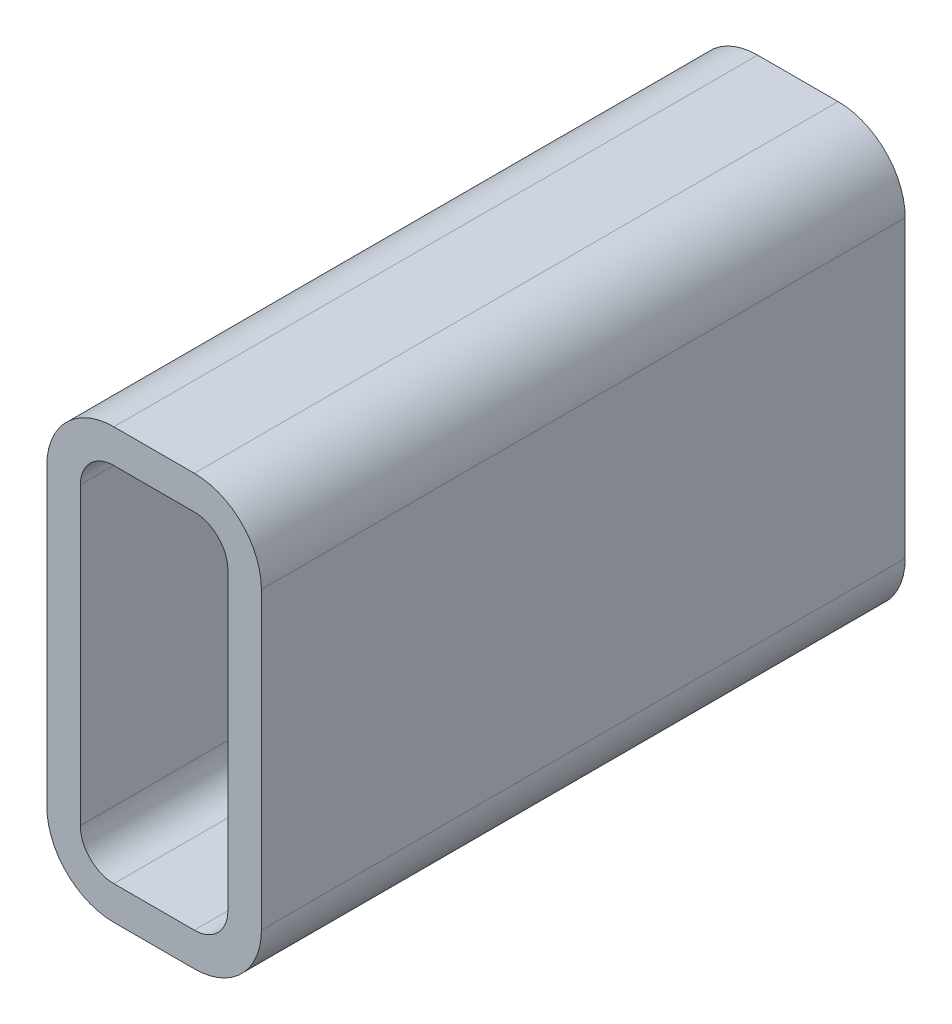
ISO-10303-21;
HEADER;
FILE_DESCRIPTION(('STEP AP214'),'2;1');
FILE_NAME('part.step','',(''),(''),'','','');
FILE_SCHEMA(('AUTOMOTIVE_DESIGN { 1 0 10303 214 1 1 1 1 }'));
ENDSEC;
DATA;
#1=APPLICATION_CONTEXT('core data for automotive mechanical design processes');
#2=APPLICATION_PROTOCOL_DEFINITION('international standard','automotive_design',2000,#1);
#3=PRODUCT_CONTEXT('',#1,'mechanical');
#4=PRODUCT('Part','Part','',(#3));
#5=PRODUCT_RELATED_PRODUCT_CATEGORY('part','',(#4));
#6=PRODUCT_DEFINITION_FORMATION('','',#4);
#7=PRODUCT_DEFINITION_CONTEXT('part definition',#1,'design');
#8=PRODUCT_DEFINITION('design','',#6,#7);
#9=PRODUCT_DEFINITION_SHAPE('','',#8);
#10=(LENGTH_UNIT() NAMED_UNIT(*) SI_UNIT(.MILLI.,.METRE.));
#11=(NAMED_UNIT(*) PLANE_ANGLE_UNIT() SI_UNIT($,.RADIAN.));
#12=(NAMED_UNIT(*) SI_UNIT($,.STERADIAN.) SOLID_ANGLE_UNIT());
#13=UNCERTAINTY_MEASURE_WITH_UNIT(LENGTH_MEASURE(1.E-05),#10,'distance_accuracy_value','');
#14=(GEOMETRIC_REPRESENTATION_CONTEXT(3) GLOBAL_UNCERTAINTY_ASSIGNED_CONTEXT((#13)) GLOBAL_UNIT_ASSIGNED_CONTEXT((#10,
#11,#12)) REPRESENTATION_CONTEXT('',''));
#15=CARTESIAN_POINT('',(0.,0.,0.));
#16=DIRECTION('',(0.,0.,1.));
#17=DIRECTION('',(1.,0.,0.));
#18=AXIS2_PLACEMENT_3D('',#15,#16,#17);
#19=CARTESIAN_POINT('',(33.4251778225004,173.416130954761,304.8));
#20=DIRECTION('',(0.,0.,1.));
#21=DIRECTION('',(1.,0.,0.));
#22=AXIS2_PLACEMENT_3D('',#19,#20,#21);
#23=PLANE('',#22);
#24=CARTESIAN_POINT('',(33.4251778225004,173.416130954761,304.8));
#25=DIRECTION('',(0.,0.,1.));
#26=DIRECTION('',(1.,0.,0.));
#27=AXIS2_PLACEMENT_3D('',#24,#25,#26);
#28=CIRCLE('',#27,31.75);
#29=CARTESIAN_POINT('',(33.4251778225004,205.166130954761,304.8));
#30=VERTEX_POINT('',#29);
#31=CARTESIAN_POINT('',(1.67517782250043,173.416130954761,304.8));
#32=VERTEX_POINT('',#31);
#33=EDGE_CURVE('E211',#30,#32,#28,.T.);
#34=ORIENTED_EDGE('',*,*,#33,.T.);
#35=DIRECTION('',(0.,-1.,0.));
#36=VECTOR('',#35,1.);
#37=CARTESIAN_POINT('',(1.67517782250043,33.7161309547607,304.8));
#38=LINE('',#37,#36);
#39=CARTESIAN_POINT('',(1.67517782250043,33.7161309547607,304.8));
#40=VERTEX_POINT('',#39);
#41=EDGE_CURVE('E214',#32,#40,#38,.T.);
#42=ORIENTED_EDGE('',*,*,#41,.T.);
#43=CARTESIAN_POINT('',(33.4251778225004,33.7161309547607,304.8));
#44=DIRECTION('',(0.,0.,1.));
#45=DIRECTION('',(1.,0.,0.));
#46=AXIS2_PLACEMENT_3D('',#43,#44,#45);
#47=CIRCLE('',#46,31.75);
#48=CARTESIAN_POINT('',(33.4251778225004,1.96613095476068,304.8));
#49=VERTEX_POINT('',#48);
#50=EDGE_CURVE('E217',#40,#49,#47,.T.);
#51=ORIENTED_EDGE('',*,*,#50,.T.);
#52=DIRECTION('',(1.,0.,0.));
#53=VECTOR('',#52,1.);
#54=CARTESIAN_POINT('',(71.5251778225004,1.96613095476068,304.8));
#55=LINE('',#54,#53);
#56=CARTESIAN_POINT('',(71.5251778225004,1.96613095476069,304.8));
#57=VERTEX_POINT('',#56);
#58=EDGE_CURVE('E219',#49,#57,#55,.T.);
#59=ORIENTED_EDGE('',*,*,#58,.T.);
#60=CARTESIAN_POINT('',(71.5251778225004,33.7161309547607,304.8));
#61=DIRECTION('',(0.,0.,1.));
#62=DIRECTION('',(1.,0.,0.));
#63=AXIS2_PLACEMENT_3D('',#60,#61,#62);
#64=CIRCLE('',#63,31.75);
#65=CARTESIAN_POINT('',(103.2751778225,33.7161309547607,304.8));
#66=VERTEX_POINT('',#65);
#67=EDGE_CURVE('E221',#57,#66,#64,.T.);
#68=ORIENTED_EDGE('',*,*,#67,.T.);
#69=DIRECTION('',(0.,1.,0.));
#70=VECTOR('',#69,1.);
#71=CARTESIAN_POINT('',(103.2751778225,173.416130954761,304.8));
#72=LINE('',#71,#70);
#73=CARTESIAN_POINT('',(103.2751778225,173.416130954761,304.8));
#74=VERTEX_POINT('',#73);
#75=EDGE_CURVE('E223',#66,#74,#72,.T.);
#76=ORIENTED_EDGE('',*,*,#75,.T.);
#77=CARTESIAN_POINT('',(71.5251778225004,173.416130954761,304.8));
#78=DIRECTION('',(0.,0.,1.));
#79=DIRECTION('',(1.,0.,0.));
#80=AXIS2_PLACEMENT_3D('',#77,#78,#79);
#81=CIRCLE('',#80,31.75);
#82=CARTESIAN_POINT('',(71.5251778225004,205.166130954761,304.8));
#83=VERTEX_POINT('',#82);
#84=EDGE_CURVE('E225',#74,#83,#81,.T.);
#85=ORIENTED_EDGE('',*,*,#84,.T.);
#86=DIRECTION('',(-1.,0.,0.));
#87=VECTOR('',#86,1.);
#88=CARTESIAN_POINT('',(33.4251778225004,205.166130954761,304.8));
#89=LINE('',#88,#87);
#90=EDGE_CURVE('E227',#83,#30,#89,.T.);
#91=ORIENTED_EDGE('',*,*,#90,.T.);
#92=EDGE_LOOP('',(#34,#42,#51,#59,#68,#76,#85,#91));
#93=FACE_BOUND('',#92,.T.);
#94=DIRECTION('',(0.,-1.,0.));
#95=VECTOR('',#94,1.);
#96=CARTESIAN_POINT('',(17.5501778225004,33.7161309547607,304.8));
#97=LINE('',#96,#95);
#98=CARTESIAN_POINT('',(17.5501778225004,173.416130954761,304.8));
#99=VERTEX_POINT('',#98);
#100=CARTESIAN_POINT('',(17.5501778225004,33.7161309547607,304.8));
#101=VERTEX_POINT('',#100);
#102=EDGE_CURVE('E154',#99,#101,#97,.T.);
#103=ORIENTED_EDGE('',*,*,#102,.F.);
#104=CARTESIAN_POINT('',(33.4251778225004,173.416130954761,304.8));
#105=DIRECTION('',(0.,0.,1.));
#106=DIRECTION('',(1.,0.,0.));
#107=AXIS2_PLACEMENT_3D('',#104,#105,#106);
#108=CIRCLE('',#107,15.875);
#109=CARTESIAN_POINT('',(33.4251778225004,189.291130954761,304.8));
#110=VERTEX_POINT('',#109);
#111=EDGE_CURVE('E146',#110,#99,#108,.T.);
#112=ORIENTED_EDGE('',*,*,#111,.F.);
#113=DIRECTION('',(-1.,0.,0.));
#114=VECTOR('',#113,1.);
#115=CARTESIAN_POINT('',(33.4251778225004,189.291130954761,304.8));
#116=LINE('',#115,#114);
#117=CARTESIAN_POINT('',(71.5251778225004,189.291130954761,304.8));
#118=VERTEX_POINT('',#117);
#119=EDGE_CURVE('E179',#118,#110,#116,.T.);
#120=ORIENTED_EDGE('',*,*,#119,.F.);
#121=CARTESIAN_POINT('',(71.5251778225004,173.416130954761,304.8));
#122=DIRECTION('',(0.,0.,1.));
#123=DIRECTION('',(1.,0.,0.));
#124=AXIS2_PLACEMENT_3D('',#121,#122,#123);
#125=CIRCLE('',#124,15.875);
#126=CARTESIAN_POINT('',(87.4001778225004,173.416130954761,304.8));
#127=VERTEX_POINT('',#126);
#128=EDGE_CURVE('E177',#127,#118,#125,.T.);
#129=ORIENTED_EDGE('',*,*,#128,.F.);
#130=DIRECTION('',(0.,1.,0.));
#131=VECTOR('',#130,1.);
#132=CARTESIAN_POINT('',(87.4001778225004,173.416130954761,304.8));
#133=LINE('',#132,#131);
#134=CARTESIAN_POINT('',(87.4001778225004,33.7161309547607,304.8));
#135=VERTEX_POINT('',#134);
#136=EDGE_CURVE('E175',#135,#127,#133,.T.);
#137=ORIENTED_EDGE('',*,*,#136,.F.);
#138=CARTESIAN_POINT('',(71.5251778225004,33.7161309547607,304.8));
#139=DIRECTION('',(0.,0.,1.));
#140=DIRECTION('',(1.,0.,0.));
#141=AXIS2_PLACEMENT_3D('',#138,#139,#140);
#142=CIRCLE('',#141,15.875);
#143=CARTESIAN_POINT('',(71.5251778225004,17.8411309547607,304.8));
#144=VERTEX_POINT('',#143);
#145=EDGE_CURVE('E173',#144,#135,#142,.T.);
#146=ORIENTED_EDGE('',*,*,#145,.F.);
#147=DIRECTION('',(1.,0.,0.));
#148=VECTOR('',#147,1.);
#149=CARTESIAN_POINT('',(71.5251778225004,17.8411309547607,304.8));
#150=LINE('',#149,#148);
#151=CARTESIAN_POINT('',(33.4251778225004,17.8411309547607,304.8));
#152=VERTEX_POINT('',#151);
#153=EDGE_CURVE('E169',#152,#144,#150,.T.);
#154=ORIENTED_EDGE('',*,*,#153,.F.);
#155=CARTESIAN_POINT('',(33.4251778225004,33.7161309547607,304.8));
#156=DIRECTION('',(0.,0.,1.));
#157=DIRECTION('',(1.,0.,0.));
#158=AXIS2_PLACEMENT_3D('',#155,#156,#157);
#159=CIRCLE('',#158,15.875);
#160=EDGE_CURVE('E167',#101,#152,#159,.T.);
#161=ORIENTED_EDGE('',*,*,#160,.F.);
#162=EDGE_LOOP('',(#103,#112,#120,#129,#137,#146,#154,#161));
#163=FACE_BOUND('',#162,.T.);
#164=ADVANCED_FACE('F33',(#93,#163),#23,.T.);
#165=CARTESIAN_POINT('',(33.4251778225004,173.416130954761,0.));
#166=DIRECTION('',(0.,0.,1.));
#167=DIRECTION('',(1.,0.,0.));
#168=AXIS2_PLACEMENT_3D('',#165,#166,#167);
#169=PLANE('',#168);
#170=CARTESIAN_POINT('',(33.4251778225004,173.416130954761,0.));
#171=DIRECTION('',(0.,0.,1.));
#172=DIRECTION('',(1.,0.,0.));
#173=AXIS2_PLACEMENT_3D('',#170,#171,#172);
#174=CIRCLE('',#173,31.75);
#175=CARTESIAN_POINT('',(33.4251778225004,205.166130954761,0.));
#176=VERTEX_POINT('',#175);
#177=CARTESIAN_POINT('',(1.67517782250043,173.416130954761,0.));
#178=VERTEX_POINT('',#177);
#179=EDGE_CURVE('E162',#176,#178,#174,.T.);
#180=ORIENTED_EDGE('',*,*,#179,.F.);
#181=DIRECTION('',(-1.,0.,0.));
#182=VECTOR('',#181,1.);
#183=CARTESIAN_POINT('',(33.4251778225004,205.166130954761,0.));
#184=LINE('',#183,#182);
#185=CARTESIAN_POINT('',(71.5251778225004,205.166130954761,0.));
#186=VERTEX_POINT('',#185);
#187=EDGE_CURVE('E215',#186,#176,#184,.T.);
#188=ORIENTED_EDGE('',*,*,#187,.F.);
#189=CARTESIAN_POINT('',(71.5251778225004,173.416130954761,0.));
#190=DIRECTION('',(0.,0.,1.));
#191=DIRECTION('',(1.,0.,0.));
#192=AXIS2_PLACEMENT_3D('',#189,#190,#191);
#193=CIRCLE('',#192,31.75);
#194=CARTESIAN_POINT('',(103.2751778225,173.416130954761,0.));
#195=VERTEX_POINT('',#194);
#196=EDGE_CURVE('E242',#195,#186,#193,.T.);
#197=ORIENTED_EDGE('',*,*,#196,.F.);
#198=DIRECTION('',(0.,1.,0.));
#199=VECTOR('',#198,1.);
#200=CARTESIAN_POINT('',(103.2751778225,173.416130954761,0.));
#201=LINE('',#200,#199);
#202=CARTESIAN_POINT('',(103.2751778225,33.7161309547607,0.));
#203=VERTEX_POINT('',#202);
#204=EDGE_CURVE('E240',#203,#195,#201,.T.);
#205=ORIENTED_EDGE('',*,*,#204,.F.);
#206=CARTESIAN_POINT('',(71.5251778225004,33.7161309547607,0.));
#207=DIRECTION('',(0.,0.,1.));
#208=DIRECTION('',(1.,0.,0.));
#209=AXIS2_PLACEMENT_3D('',#206,#207,#208);
#210=CIRCLE('',#209,31.75);
#211=CARTESIAN_POINT('',(71.5251778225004,1.96613095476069,0.));
#212=VERTEX_POINT('',#211);
#213=EDGE_CURVE('E238',#212,#203,#210,.T.);
#214=ORIENTED_EDGE('',*,*,#213,.F.);
#215=DIRECTION('',(1.,0.,0.));
#216=VECTOR('',#215,1.);
#217=CARTESIAN_POINT('',(71.5251778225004,1.96613095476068,0.));
#218=LINE('',#217,#216);
#219=CARTESIAN_POINT('',(33.4251778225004,1.96613095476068,0.));
#220=VERTEX_POINT('',#219);
#221=EDGE_CURVE('E236',#220,#212,#218,.T.);
#222=ORIENTED_EDGE('',*,*,#221,.F.);
#223=CARTESIAN_POINT('',(33.4251778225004,33.7161309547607,0.));
#224=DIRECTION('',(0.,0.,1.));
#225=DIRECTION('',(1.,0.,0.));
#226=AXIS2_PLACEMENT_3D('',#223,#224,#225);
#227=CIRCLE('',#226,31.75);
#228=CARTESIAN_POINT('',(1.67517782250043,33.7161309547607,0.));
#229=VERTEX_POINT('',#228);
#230=EDGE_CURVE('E234',#229,#220,#227,.T.);
#231=ORIENTED_EDGE('',*,*,#230,.F.);
#232=DIRECTION('',(0.,-1.,0.));
#233=VECTOR('',#232,1.);
#234=CARTESIAN_POINT('',(1.67517782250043,33.7161309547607,0.));
#235=LINE('',#234,#233);
#236=EDGE_CURVE('E232',#178,#229,#235,.T.);
#237=ORIENTED_EDGE('',*,*,#236,.F.);
#238=EDGE_LOOP('',(#180,#188,#197,#205,#214,#222,#231,#237));
#239=FACE_BOUND('',#238,.T.);
#240=CARTESIAN_POINT('',(33.4251778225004,173.416130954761,0.));
#241=DIRECTION('',(0.,0.,1.));
#242=DIRECTION('',(1.,0.,0.));
#243=AXIS2_PLACEMENT_3D('',#240,#241,#242);
#244=CIRCLE('',#243,15.875);
#245=CARTESIAN_POINT('',(33.4251778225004,189.291130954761,0.));
#246=VERTEX_POINT('',#245);
#247=CARTESIAN_POINT('',(17.5501778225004,173.416130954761,0.));
#248=VERTEX_POINT('',#247);
#249=EDGE_CURVE('E56',#246,#248,#244,.T.);
#250=ORIENTED_EDGE('',*,*,#249,.T.);
#251=DIRECTION('',(0.,-1.,0.));
#252=VECTOR('',#251,1.);
#253=CARTESIAN_POINT('',(17.5501778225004,33.7161309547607,0.));
#254=LINE('',#253,#252);
#255=CARTESIAN_POINT('',(17.5501778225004,33.7161309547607,0.));
#256=VERTEX_POINT('',#255);
#257=EDGE_CURVE('E161',#248,#256,#254,.T.);
#258=ORIENTED_EDGE('',*,*,#257,.T.);
#259=CARTESIAN_POINT('',(33.4251778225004,33.7161309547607,0.));
#260=DIRECTION('',(0.,0.,1.));
#261=DIRECTION('',(1.,0.,0.));
#262=AXIS2_PLACEMENT_3D('',#259,#260,#261);
#263=CIRCLE('',#262,15.875);
#264=CARTESIAN_POINT('',(33.4251778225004,17.8411309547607,0.));
#265=VERTEX_POINT('',#264);
#266=EDGE_CURVE('E183',#256,#265,#263,.T.);
#267=ORIENTED_EDGE('',*,*,#266,.T.);
#268=DIRECTION('',(1.,0.,0.));
#269=VECTOR('',#268,1.);
#270=CARTESIAN_POINT('',(71.5251778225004,17.8411309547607,0.));
#271=LINE('',#270,#269);
#272=CARTESIAN_POINT('',(71.5251778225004,17.8411309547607,0.));
#273=VERTEX_POINT('',#272);
#274=EDGE_CURVE('E186',#265,#273,#271,.T.);
#275=ORIENTED_EDGE('',*,*,#274,.T.);
#276=CARTESIAN_POINT('',(71.5251778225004,33.7161309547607,0.));
#277=DIRECTION('',(0.,0.,1.));
#278=DIRECTION('',(1.,0.,0.));
#279=AXIS2_PLACEMENT_3D('',#276,#277,#278);
#280=CIRCLE('',#279,15.875);
#281=CARTESIAN_POINT('',(87.4001778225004,33.7161309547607,0.));
#282=VERTEX_POINT('',#281);
#283=EDGE_CURVE('E189',#273,#282,#280,.T.);
#284=ORIENTED_EDGE('',*,*,#283,.T.);
#285=DIRECTION('',(0.,1.,0.));
#286=VECTOR('',#285,1.);
#287=CARTESIAN_POINT('',(87.4001778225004,173.416130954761,0.));
#288=LINE('',#287,#286);
#289=CARTESIAN_POINT('',(87.4001778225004,173.416130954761,0.));
#290=VERTEX_POINT('',#289);
#291=EDGE_CURVE('E192',#282,#290,#288,.T.);
#292=ORIENTED_EDGE('',*,*,#291,.T.);
#293=CARTESIAN_POINT('',(71.5251778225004,173.416130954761,0.));
#294=DIRECTION('',(0.,0.,1.));
#295=DIRECTION('',(1.,0.,0.));
#296=AXIS2_PLACEMENT_3D('',#293,#294,#295);
#297=CIRCLE('',#296,15.875);
#298=CARTESIAN_POINT('',(71.5251778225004,189.291130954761,0.));
#299=VERTEX_POINT('',#298);
#300=EDGE_CURVE('E195',#290,#299,#297,.T.);
#301=ORIENTED_EDGE('',*,*,#300,.T.);
#302=DIRECTION('',(-1.,0.,0.));
#303=VECTOR('',#302,1.);
#304=CARTESIAN_POINT('',(33.4251778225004,189.291130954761,0.));
#305=LINE('',#304,#303);
#306=EDGE_CURVE('E155',#299,#246,#305,.T.);
#307=ORIENTED_EDGE('',*,*,#306,.T.);
#308=EDGE_LOOP('',(#250,#258,#267,#275,#284,#292,#301,#307));
#309=FACE_BOUND('',#308,.T.);
#310=ADVANCED_FACE('F272',(#239,#309),#169,.F.);
#311=CARTESIAN_POINT('',(33.4251778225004,173.416130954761,304.8));
#312=DIRECTION('',(0.,0.,-1.));
#313=DIRECTION('',(-1.,0.,0.));
#314=AXIS2_PLACEMENT_3D('',#311,#312,#313);
#315=CYLINDRICAL_SURFACE('',#314,31.75);
#316=ORIENTED_EDGE('',*,*,#179,.T.);
#317=DIRECTION('',(0.,0.,-1.));
#318=VECTOR('',#317,1.);
#319=CARTESIAN_POINT('',(1.67517782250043,173.416130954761,304.8));
#320=LINE('',#319,#318);
#321=EDGE_CURVE('E11',#32,#178,#320,.T.);
#322=ORIENTED_EDGE('',*,*,#321,.F.);
#323=ORIENTED_EDGE('',*,*,#33,.F.);
#324=DIRECTION('',(0.,0.,-1.));
#325=VECTOR('',#324,1.);
#326=CARTESIAN_POINT('',(33.4251778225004,205.166130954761,304.8));
#327=LINE('',#326,#325);
#328=EDGE_CURVE('E229',#30,#176,#327,.T.);
#329=ORIENTED_EDGE('',*,*,#328,.T.);
#330=EDGE_LOOP('',(#316,#322,#323,#329));
#331=FACE_BOUND('',#330,.T.);
#332=ADVANCED_FACE('F35',(#331),#315,.T.);
#333=CARTESIAN_POINT('',(1.67517782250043,33.7161309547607,304.8));
#334=DIRECTION('',(1.,0.,0.));
#335=DIRECTION('',(0.,0.,-1.));
#336=AXIS2_PLACEMENT_3D('',#333,#334,#335);
#337=PLANE('',#336);
#338=ORIENTED_EDGE('',*,*,#236,.T.);
#339=DIRECTION('',(0.,0.,-1.));
#340=VECTOR('',#339,1.);
#341=CARTESIAN_POINT('',(1.67517782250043,33.7161309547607,304.8));
#342=LINE('',#341,#340);
#343=EDGE_CURVE('E41',#40,#229,#342,.T.);
#344=ORIENTED_EDGE('',*,*,#343,.F.);
#345=ORIENTED_EDGE('',*,*,#41,.F.);
#346=ORIENTED_EDGE('',*,*,#321,.T.);
#347=EDGE_LOOP('',(#338,#344,#345,#346));
#348=FACE_BOUND('',#347,.T.);
#349=ADVANCED_FACE('F289',(#348),#337,.F.);
#350=CARTESIAN_POINT('',(33.4251778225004,33.7161309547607,304.8));
#351=DIRECTION('',(0.,0.,-1.));
#352=DIRECTION('',(-1.,0.,0.));
#353=AXIS2_PLACEMENT_3D('',#350,#351,#352);
#354=CYLINDRICAL_SURFACE('',#353,31.75);
#355=ORIENTED_EDGE('',*,*,#230,.T.);
#356=DIRECTION('',(0.,0.,-1.));
#357=VECTOR('',#356,1.);
#358=CARTESIAN_POINT('',(33.4251778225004,1.96613095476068,304.8));
#359=LINE('',#358,#357);
#360=EDGE_CURVE('E259',#49,#220,#359,.T.);
#361=ORIENTED_EDGE('',*,*,#360,.F.);
#362=ORIENTED_EDGE('',*,*,#50,.F.);
#363=ORIENTED_EDGE('',*,*,#343,.T.);
#364=EDGE_LOOP('',(#355,#361,#362,#363));
#365=FACE_BOUND('',#364,.T.);
#366=ADVANCED_FACE('F266',(#365),#354,.T.);
#367=CARTESIAN_POINT('',(71.5251778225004,1.96613095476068,304.8));
#368=DIRECTION('',(0.,1.,0.));
#369=DIRECTION('',(0.,0.,1.));
#370=AXIS2_PLACEMENT_3D('',#367,#368,#369);
#371=PLANE('',#370);
#372=ORIENTED_EDGE('',*,*,#221,.T.);
#373=DIRECTION('',(0.,0.,-1.));
#374=VECTOR('',#373,1.);
#375=CARTESIAN_POINT('',(71.5251778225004,1.96613095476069,304.8));
#376=LINE('',#375,#374);
#377=EDGE_CURVE('E256',#57,#212,#376,.T.);
#378=ORIENTED_EDGE('',*,*,#377,.F.);
#379=ORIENTED_EDGE('',*,*,#58,.F.);
#380=ORIENTED_EDGE('',*,*,#360,.T.);
#381=EDGE_LOOP('',(#372,#378,#379,#380));
#382=FACE_BOUND('',#381,.T.);
#383=ADVANCED_FACE('F278',(#382),#371,.F.);
#384=CARTESIAN_POINT('',(71.5251778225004,33.7161309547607,304.8));
#385=DIRECTION('',(0.,0.,-1.));
#386=DIRECTION('',(-1.,0.,0.));
#387=AXIS2_PLACEMENT_3D('',#384,#385,#386);
#388=CYLINDRICAL_SURFACE('',#387,31.75);
#389=ORIENTED_EDGE('',*,*,#213,.T.);
#390=DIRECTION('',(0.,0.,-1.));
#391=VECTOR('',#390,1.);
#392=CARTESIAN_POINT('',(103.2751778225,33.7161309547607,304.8));
#393=LINE('',#392,#391);
#394=EDGE_CURVE('E253',#66,#203,#393,.T.);
#395=ORIENTED_EDGE('',*,*,#394,.F.);
#396=ORIENTED_EDGE('',*,*,#67,.F.);
#397=ORIENTED_EDGE('',*,*,#377,.T.);
#398=EDGE_LOOP('',(#389,#395,#396,#397));
#399=FACE_BOUND('',#398,.T.);
#400=ADVANCED_FACE('F282',(#399),#388,.T.);
#401=CARTESIAN_POINT('',(103.2751778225,173.416130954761,304.8));
#402=DIRECTION('',(-1.,0.,0.));
#403=DIRECTION('',(0.,0.,1.));
#404=AXIS2_PLACEMENT_3D('',#401,#402,#403);
#405=PLANE('',#404);
#406=ORIENTED_EDGE('',*,*,#204,.T.);
#407=DIRECTION('',(0.,0.,-1.));
#408=VECTOR('',#407,1.);
#409=CARTESIAN_POINT('',(103.2751778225,173.416130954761,304.8));
#410=LINE('',#409,#408);
#411=EDGE_CURVE('E250',#74,#195,#410,.T.);
#412=ORIENTED_EDGE('',*,*,#411,.F.);
#413=ORIENTED_EDGE('',*,*,#75,.F.);
#414=ORIENTED_EDGE('',*,*,#394,.T.);
#415=EDGE_LOOP('',(#406,#412,#413,#414));
#416=FACE_BOUND('',#415,.T.);
#417=ADVANCED_FACE('F302',(#416),#405,.F.);
#418=CARTESIAN_POINT('',(71.5251778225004,173.416130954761,304.8));
#419=DIRECTION('',(0.,0.,-1.));
#420=DIRECTION('',(-1.,0.,0.));
#421=AXIS2_PLACEMENT_3D('',#418,#419,#420);
#422=CYLINDRICAL_SURFACE('',#421,31.75);
#423=ORIENTED_EDGE('',*,*,#196,.T.);
#424=DIRECTION('',(0.,0.,-1.));
#425=VECTOR('',#424,1.);
#426=CARTESIAN_POINT('',(71.5251778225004,205.166130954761,304.8));
#427=LINE('',#426,#425);
#428=EDGE_CURVE('E247',#83,#186,#427,.T.);
#429=ORIENTED_EDGE('',*,*,#428,.F.);
#430=ORIENTED_EDGE('',*,*,#84,.F.);
#431=ORIENTED_EDGE('',*,*,#411,.T.);
#432=EDGE_LOOP('',(#423,#429,#430,#431));
#433=FACE_BOUND('',#432,.T.);
#434=ADVANCED_FACE('F300',(#433),#422,.T.);
#435=CARTESIAN_POINT('',(33.4251778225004,205.166130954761,304.8));
#436=DIRECTION('',(0.,-1.,0.));
#437=DIRECTION('',(0.,0.,-1.));
#438=AXIS2_PLACEMENT_3D('',#435,#436,#437);
#439=PLANE('',#438);
#440=ORIENTED_EDGE('',*,*,#187,.T.);
#441=ORIENTED_EDGE('',*,*,#328,.F.);
#442=ORIENTED_EDGE('',*,*,#90,.F.);
#443=ORIENTED_EDGE('',*,*,#428,.T.);
#444=EDGE_LOOP('',(#440,#441,#442,#443));
#445=FACE_BOUND('',#444,.T.);
#446=ADVANCED_FACE('F295',(#445),#439,.F.);
#447=CARTESIAN_POINT('',(33.4251778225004,173.416130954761,304.8));
#448=DIRECTION('',(0.,0.,-1.));
#449=DIRECTION('',(-1.,0.,0.));
#450=AXIS2_PLACEMENT_3D('',#447,#448,#449);
#451=CYLINDRICAL_SURFACE('',#450,15.875);
#452=ORIENTED_EDGE('',*,*,#249,.F.);
#453=DIRECTION('',(0.,0.,-1.));
#454=VECTOR('',#453,1.);
#455=CARTESIAN_POINT('',(33.4251778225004,189.291130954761,304.8));
#456=LINE('',#455,#454);
#457=EDGE_CURVE('E150',#110,#246,#456,.T.);
#458=ORIENTED_EDGE('',*,*,#457,.F.);
#459=ORIENTED_EDGE('',*,*,#111,.T.);
#460=DIRECTION('',(0.,0.,-1.));
#461=VECTOR('',#460,1.);
#462=CARTESIAN_POINT('',(17.5501778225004,173.416130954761,304.8));
#463=LINE('',#462,#461);
#464=EDGE_CURVE('E149',#99,#248,#463,.T.);
#465=ORIENTED_EDGE('',*,*,#464,.T.);
#466=EDGE_LOOP('',(#452,#458,#459,#465));
#467=FACE_BOUND('',#466,.T.);
#468=ADVANCED_FACE('F148',(#467),#451,.F.);
#469=CARTESIAN_POINT('',(17.5501778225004,33.7161309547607,304.8));
#470=DIRECTION('',(1.,0.,0.));
#471=DIRECTION('',(0.,0.,-1.));
#472=AXIS2_PLACEMENT_3D('',#469,#470,#471);
#473=PLANE('',#472);
#474=ORIENTED_EDGE('',*,*,#257,.F.);
#475=ORIENTED_EDGE('',*,*,#464,.F.);
#476=ORIENTED_EDGE('',*,*,#102,.T.);
#477=DIRECTION('',(0.,0.,-1.));
#478=VECTOR('',#477,1.);
#479=CARTESIAN_POINT('',(17.5501778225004,33.7161309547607,304.8));
#480=LINE('',#479,#478);
#481=EDGE_CURVE('E163',#101,#256,#480,.T.);
#482=ORIENTED_EDGE('',*,*,#481,.T.);
#483=EDGE_LOOP('',(#474,#475,#476,#482));
#484=FACE_BOUND('',#483,.T.);
#485=ADVANCED_FACE('F158',(#484),#473,.T.);
#486=CARTESIAN_POINT('',(33.4251778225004,33.7161309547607,304.8));
#487=DIRECTION('',(0.,0.,-1.));
#488=DIRECTION('',(-1.,0.,0.));
#489=AXIS2_PLACEMENT_3D('',#486,#487,#488);
#490=CYLINDRICAL_SURFACE('',#489,15.875);
#491=ORIENTED_EDGE('',*,*,#266,.F.);
#492=ORIENTED_EDGE('',*,*,#481,.F.);
#493=ORIENTED_EDGE('',*,*,#160,.T.);
#494=DIRECTION('',(0.,0.,-1.));
#495=VECTOR('',#494,1.);
#496=CARTESIAN_POINT('',(33.4251778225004,17.8411309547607,304.8));
#497=LINE('',#496,#495);
#498=EDGE_CURVE('E208',#152,#265,#497,.T.);
#499=ORIENTED_EDGE('',*,*,#498,.T.);
#500=EDGE_LOOP('',(#491,#492,#493,#499));
#501=FACE_BOUND('',#500,.T.);
#502=ADVANCED_FACE('F327',(#501),#490,.F.);
#503=CARTESIAN_POINT('',(71.5251778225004,17.8411309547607,304.8));
#504=DIRECTION('',(0.,1.,0.));
#505=DIRECTION('',(0.,0.,1.));
#506=AXIS2_PLACEMENT_3D('',#503,#504,#505);
#507=PLANE('',#506);
#508=ORIENTED_EDGE('',*,*,#274,.F.);
#509=ORIENTED_EDGE('',*,*,#498,.F.);
#510=ORIENTED_EDGE('',*,*,#153,.T.);
#511=DIRECTION('',(0.,0.,-1.));
#512=VECTOR('',#511,1.);
#513=CARTESIAN_POINT('',(71.5251778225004,17.8411309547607,304.8));
#514=LINE('',#513,#512);
#515=EDGE_CURVE('E206',#144,#273,#514,.T.);
#516=ORIENTED_EDGE('',*,*,#515,.T.);
#517=EDGE_LOOP('',(#508,#509,#510,#516));
#518=FACE_BOUND('',#517,.T.);
#519=ADVANCED_FACE('F331',(#518),#507,.T.);
#520=CARTESIAN_POINT('',(71.5251778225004,33.7161309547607,304.8));
#521=DIRECTION('',(0.,0.,-1.));
#522=DIRECTION('',(-1.,0.,0.));
#523=AXIS2_PLACEMENT_3D('',#520,#521,#522);
#524=CYLINDRICAL_SURFACE('',#523,15.875);
#525=ORIENTED_EDGE('',*,*,#283,.F.);
#526=ORIENTED_EDGE('',*,*,#515,.F.);
#527=ORIENTED_EDGE('',*,*,#145,.T.);
#528=DIRECTION('',(0.,0.,-1.));
#529=VECTOR('',#528,1.);
#530=CARTESIAN_POINT('',(87.4001778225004,33.7161309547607,304.8));
#531=LINE('',#530,#529);
#532=EDGE_CURVE('E204',#135,#282,#531,.T.);
#533=ORIENTED_EDGE('',*,*,#532,.T.);
#534=EDGE_LOOP('',(#525,#526,#527,#533));
#535=FACE_BOUND('',#534,.T.);
#536=ADVANCED_FACE('F337',(#535),#524,.F.);
#537=CARTESIAN_POINT('',(87.4001778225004,173.416130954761,304.8));
#538=DIRECTION('',(-1.,0.,0.));
#539=DIRECTION('',(0.,0.,1.));
#540=AXIS2_PLACEMENT_3D('',#537,#538,#539);
#541=PLANE('',#540);
#542=ORIENTED_EDGE('',*,*,#291,.F.);
#543=ORIENTED_EDGE('',*,*,#532,.F.);
#544=ORIENTED_EDGE('',*,*,#136,.T.);
#545=DIRECTION('',(0.,0.,-1.));
#546=VECTOR('',#545,1.);
#547=CARTESIAN_POINT('',(87.4001778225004,173.416130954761,304.8));
#548=LINE('',#547,#546);
#549=EDGE_CURVE('E202',#127,#290,#548,.T.);
#550=ORIENTED_EDGE('',*,*,#549,.T.);
#551=EDGE_LOOP('',(#542,#543,#544,#550));
#552=FACE_BOUND('',#551,.T.);
#553=ADVANCED_FACE('F341',(#552),#541,.T.);
#554=CARTESIAN_POINT('',(71.5251778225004,173.416130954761,304.8));
#555=DIRECTION('',(0.,0.,-1.));
#556=DIRECTION('',(-1.,0.,0.));
#557=AXIS2_PLACEMENT_3D('',#554,#555,#556);
#558=CYLINDRICAL_SURFACE('',#557,15.875);
#559=ORIENTED_EDGE('',*,*,#300,.F.);
#560=ORIENTED_EDGE('',*,*,#549,.F.);
#561=ORIENTED_EDGE('',*,*,#128,.T.);
#562=DIRECTION('',(0.,0.,-1.));
#563=VECTOR('',#562,1.);
#564=CARTESIAN_POINT('',(71.5251778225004,189.291130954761,304.8));
#565=LINE('',#564,#563);
#566=EDGE_CURVE('E48',#118,#299,#565,.T.);
#567=ORIENTED_EDGE('',*,*,#566,.T.);
#568=EDGE_LOOP('',(#559,#560,#561,#567));
#569=FACE_BOUND('',#568,.T.);
#570=ADVANCED_FACE('F345',(#569),#558,.F.);
#571=CARTESIAN_POINT('',(33.4251778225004,189.291130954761,304.8));
#572=DIRECTION('',(0.,-1.,0.));
#573=DIRECTION('',(0.,0.,-1.));
#574=AXIS2_PLACEMENT_3D('',#571,#572,#573);
#575=PLANE('',#574);
#576=ORIENTED_EDGE('',*,*,#306,.F.);
#577=ORIENTED_EDGE('',*,*,#566,.F.);
#578=ORIENTED_EDGE('',*,*,#119,.T.);
#579=ORIENTED_EDGE('',*,*,#457,.T.);
#580=EDGE_LOOP('',(#576,#577,#578,#579));
#581=FACE_BOUND('',#580,.T.);
#582=ADVANCED_FACE('F349',(#581),#575,.T.);
#583=CLOSED_SHELL('',(#164,#310,#332,#349,#366,#383,#400,#417,#434,#446,#468,#485,#502,#519,
#536,#553,#570,#582));
#584=MANIFOLD_SOLID_BREP('B2',#583);
#585=ADVANCED_BREP_SHAPE_REPRESENTATION('',(#18,#584),#14);
#586=SHAPE_DEFINITION_REPRESENTATION(#9,#585);
ENDSEC;
END-ISO-10303-21;
